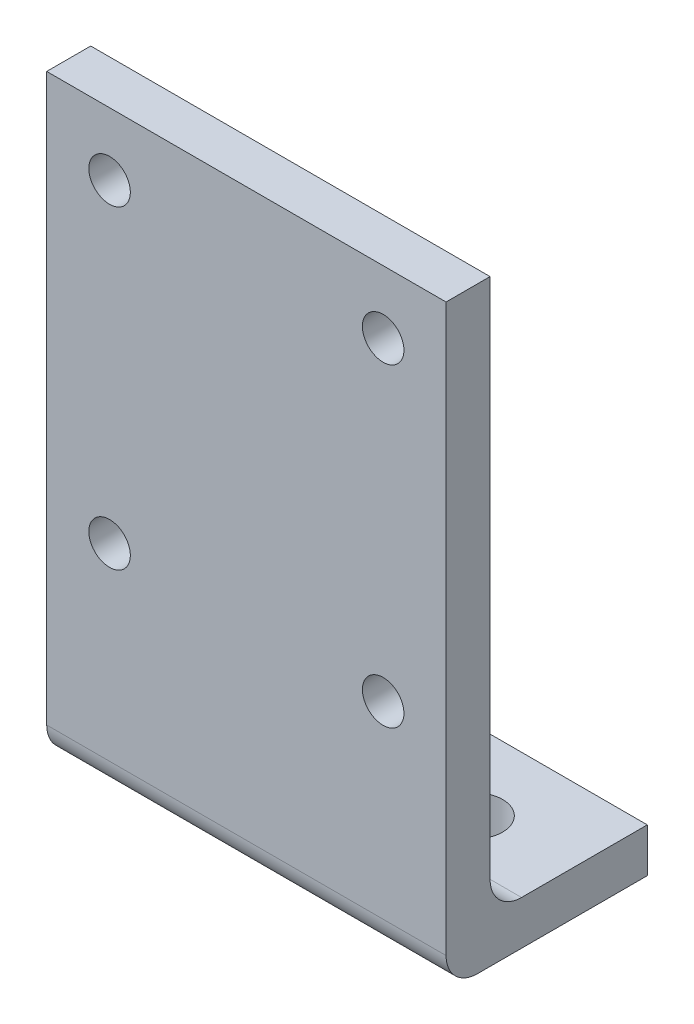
ISO-10303-21;
HEADER;
FILE_DESCRIPTION(('STEP AP214'),'2;1');
FILE_NAME('part.step','',(''),(''),'','','');
FILE_SCHEMA(('AUTOMOTIVE_DESIGN { 1 0 10303 214 1 1 1 1 }'));
ENDSEC;
DATA;
#1=APPLICATION_CONTEXT('core data for automotive mechanical design processes');
#2=APPLICATION_PROTOCOL_DEFINITION('international standard','automotive_design',2000,#1);
#3=PRODUCT_CONTEXT('',#1,'mechanical');
#4=PRODUCT('Part','Part','',(#3));
#5=PRODUCT_RELATED_PRODUCT_CATEGORY('part','',(#4));
#6=PRODUCT_DEFINITION_FORMATION('','',#4);
#7=PRODUCT_DEFINITION_CONTEXT('part definition',#1,'design');
#8=PRODUCT_DEFINITION('design','',#6,#7);
#9=PRODUCT_DEFINITION_SHAPE('','',#8);
#10=(LENGTH_UNIT() NAMED_UNIT(*) SI_UNIT(.MILLI.,.METRE.));
#11=(NAMED_UNIT(*) PLANE_ANGLE_UNIT() SI_UNIT($,.RADIAN.));
#12=(NAMED_UNIT(*) SI_UNIT($,.STERADIAN.) SOLID_ANGLE_UNIT());
#13=UNCERTAINTY_MEASURE_WITH_UNIT(LENGTH_MEASURE(1.E-05),#10,'distance_accuracy_value','');
#14=(GEOMETRIC_REPRESENTATION_CONTEXT(3) GLOBAL_UNCERTAINTY_ASSIGNED_CONTEXT((#13)) GLOBAL_UNIT_ASSIGNED_CONTEXT((#10,
#11,#12)) REPRESENTATION_CONTEXT('',''));
#15=CARTESIAN_POINT('',(0.,0.,0.));
#16=DIRECTION('',(0.,0.,1.));
#17=DIRECTION('',(1.,0.,0.));
#18=AXIS2_PLACEMENT_3D('',#15,#16,#17);
#19=CARTESIAN_POINT('',(31.75,-35.5,-5.));
#20=DIRECTION('',(1.,0.,0.));
#21=DIRECTION('',(0.,0.,-1.));
#22=AXIS2_PLACEMENT_3D('',#19,#20,#21);
#23=CYLINDRICAL_SURFACE('',#22,5.);
#24=DIRECTION('',(1.,0.,0.));
#25=VECTOR('',#24,1.);
#26=CARTESIAN_POINT('',(31.75,-40.5,-5.));
#27=LINE('',#26,#25);
#28=CARTESIAN_POINT('',(-31.75,-40.5,-5.));
#29=VERTEX_POINT('',#28);
#30=CARTESIAN_POINT('',(31.75,-40.5,-5.));
#31=VERTEX_POINT('',#30);
#32=EDGE_CURVE('E182',#29,#31,#27,.T.);
#33=ORIENTED_EDGE('',*,*,#32,.F.);
#34=CARTESIAN_POINT('',(-31.75,-35.5,-5.));
#35=DIRECTION('',(1.,0.,0.));
#36=DIRECTION('',(0.,0.,-1.));
#37=AXIS2_PLACEMENT_3D('',#34,#35,#36);
#38=CIRCLE('',#37,5.);
#39=CARTESIAN_POINT('',(-31.75,-35.5,0.));
#40=VERTEX_POINT('',#39);
#41=EDGE_CURVE('E46',#29,#40,#38,.F.);
#42=ORIENTED_EDGE('',*,*,#41,.T.);
#43=DIRECTION('',(1.,0.,0.));
#44=VECTOR('',#43,1.);
#45=CARTESIAN_POINT('',(31.75,-35.5,0.));
#46=LINE('',#45,#44);
#47=CARTESIAN_POINT('',(31.75,-35.5,0.));
#48=VERTEX_POINT('',#47);
#49=EDGE_CURVE('E185',#48,#40,#46,.F.);
#50=ORIENTED_EDGE('',*,*,#49,.F.);
#51=CARTESIAN_POINT('',(31.75,-35.5,-5.));
#52=DIRECTION('',(-1.,0.,0.));
#53=DIRECTION('',(0.,0.,1.));
#54=AXIS2_PLACEMENT_3D('',#51,#52,#53);
#55=CIRCLE('',#54,5.);
#56=EDGE_CURVE('E12',#48,#31,#55,.F.);
#57=ORIENTED_EDGE('',*,*,#56,.T.);
#58=EDGE_LOOP('',(#33,#42,#50,#57));
#59=FACE_BOUND('',#58,.T.);
#60=ADVANCED_FACE('F39',(#59),#23,.F.);
#61=CARTESIAN_POINT('',(-31.75,-42.5,2.));
#62=DIRECTION('',(-1.,0.,0.));
#63=DIRECTION('',(0.,0.,1.));
#64=AXIS2_PLACEMENT_3D('',#61,#62,#63);
#65=CYLINDRICAL_SURFACE('',#64,5.);
#66=DIRECTION('',(-1.,0.,0.));
#67=VECTOR('',#66,1.);
#68=CARTESIAN_POINT('',(-31.75,-47.5,2.));
#69=LINE('',#68,#67);
#70=CARTESIAN_POINT('',(31.75,-47.5,2.));
#71=VERTEX_POINT('',#70);
#72=CARTESIAN_POINT('',(-31.75,-47.5,2.));
#73=VERTEX_POINT('',#72);
#74=EDGE_CURVE('E202',#71,#73,#69,.T.);
#75=ORIENTED_EDGE('',*,*,#74,.F.);
#76=CARTESIAN_POINT('',(31.75,-42.5,2.));
#77=DIRECTION('',(-1.,0.,0.));
#78=DIRECTION('',(0.,0.,1.));
#79=AXIS2_PLACEMENT_3D('',#76,#77,#78);
#80=CIRCLE('',#79,5.);
#81=CARTESIAN_POINT('',(31.75,-42.5,7.));
#82=VERTEX_POINT('',#81);
#83=EDGE_CURVE('E105',#82,#71,#80,.F.);
#84=ORIENTED_EDGE('',*,*,#83,.F.);
#85=DIRECTION('',(-1.,0.,0.));
#86=VECTOR('',#85,1.);
#87=CARTESIAN_POINT('',(31.75,-42.5,7.));
#88=LINE('',#87,#86);
#89=CARTESIAN_POINT('',(-31.75,-42.5,7.));
#90=VERTEX_POINT('',#89);
#91=EDGE_CURVE('E197',#90,#82,#88,.F.);
#92=ORIENTED_EDGE('',*,*,#91,.F.);
#93=CARTESIAN_POINT('',(-31.75,-42.5,2.));
#94=DIRECTION('',(1.,0.,0.));
#95=DIRECTION('',(0.,0.,-1.));
#96=AXIS2_PLACEMENT_3D('',#93,#94,#95);
#97=CIRCLE('',#96,5.);
#98=EDGE_CURVE('E191',#73,#90,#97,.F.);
#99=ORIENTED_EDGE('',*,*,#98,.F.);
#100=EDGE_LOOP('',(#75,#84,#92,#99));
#101=FACE_BOUND('',#100,.T.);
#102=ADVANCED_FACE('F285',(#101),#65,.T.);
#103=CARTESIAN_POINT('',(31.75,-40.5,-25.));
#104=DIRECTION('',(0.,-1.,0.));
#105=DIRECTION('',(0.,0.,-1.));
#106=AXIS2_PLACEMENT_3D('',#103,#104,#105);
#107=PLANE('',#106);
#108=DIRECTION('',(0.,0.,1.));
#109=VECTOR('',#108,1.);
#110=CARTESIAN_POINT('',(-31.75,-40.5,-25.));
#111=LINE('',#110,#109);
#112=CARTESIAN_POINT('',(-31.75,-40.5,-25.));
#113=VERTEX_POINT('',#112);
#114=EDGE_CURVE('E181',#113,#29,#111,.T.);
#115=ORIENTED_EDGE('',*,*,#114,.T.);
#116=ORIENTED_EDGE('',*,*,#32,.T.);
#117=DIRECTION('',(0.,0.,1.));
#118=VECTOR('',#117,1.);
#119=CARTESIAN_POINT('',(31.75,-40.5,-25.));
#120=LINE('',#119,#118);
#121=CARTESIAN_POINT('',(31.75,-40.5,-25.));
#122=VERTEX_POINT('',#121);
#123=EDGE_CURVE('E264',#122,#31,#120,.T.);
#124=ORIENTED_EDGE('',*,*,#123,.F.);
#125=DIRECTION('',(1.,0.,0.));
#126=VECTOR('',#125,1.);
#127=CARTESIAN_POINT('',(31.75,-40.5,-25.));
#128=LINE('',#127,#126);
#129=EDGE_CURVE('E122',#113,#122,#128,.T.);
#130=ORIENTED_EDGE('',*,*,#129,.F.);
#131=EDGE_LOOP('',(#115,#116,#124,#130));
#132=FACE_BOUND('',#131,.T.);
#133=CARTESIAN_POINT('',(16.75,-40.5,-12.5));
#134=DIRECTION('',(0.,1.,0.));
#135=DIRECTION('',(0.,0.,1.));
#136=AXIS2_PLACEMENT_3D('',#133,#134,#135);
#137=CIRCLE('',#136,4.49999999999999);
#138=CARTESIAN_POINT('',(16.75,-40.5,-8.00000000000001));
#139=VERTEX_POINT('',#138);
#140=EDGE_CURVE('E147',#139,#139,#137,.T.);
#141=ORIENTED_EDGE('',*,*,#140,.F.);
#142=EDGE_LOOP('',(#141));
#143=FACE_BOUND('',#142,.T.);
#144=CARTESIAN_POINT('',(-16.75,-40.5,-12.5));
#145=DIRECTION('',(0.,1.,0.));
#146=DIRECTION('',(0.,0.,1.));
#147=AXIS2_PLACEMENT_3D('',#144,#145,#146);
#148=CIRCLE('',#147,4.49999999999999);
#149=CARTESIAN_POINT('',(-16.75,-40.5,-8.00000000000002));
#150=VERTEX_POINT('',#149);
#151=EDGE_CURVE('E322',#150,#150,#148,.T.);
#152=ORIENTED_EDGE('',*,*,#151,.F.);
#153=EDGE_LOOP('',(#152));
#154=FACE_BOUND('',#153,.T.);
#155=ADVANCED_FACE('F272',(#132,#143,#154),#107,.F.);
#156=CARTESIAN_POINT('',(31.75,-47.5,7.));
#157=DIRECTION('',(-1.,0.,0.));
#158=DIRECTION('',(0.,0.,1.));
#159=AXIS2_PLACEMENT_3D('',#156,#157,#158);
#160=PLANE('',#159);
#161=ORIENTED_EDGE('',*,*,#56,.F.);
#162=DIRECTION('',(0.,1.,0.));
#163=VECTOR('',#162,1.);
#164=CARTESIAN_POINT('',(31.75,-47.5,0.));
#165=LINE('',#164,#163);
#166=CARTESIAN_POINT('',(31.75,47.5,0.));
#167=VERTEX_POINT('',#166);
#168=EDGE_CURVE('E178',#48,#167,#165,.T.);
#169=ORIENTED_EDGE('',*,*,#168,.T.);
#170=DIRECTION('',(0.,0.,-1.));
#171=VECTOR('',#170,1.);
#172=CARTESIAN_POINT('',(31.75,47.5,7.));
#173=LINE('',#172,#171);
#174=CARTESIAN_POINT('',(31.75,47.5,7.));
#175=VERTEX_POINT('',#174);
#176=EDGE_CURVE('E203',#175,#167,#173,.T.);
#177=ORIENTED_EDGE('',*,*,#176,.F.);
#178=DIRECTION('',(0.,1.,0.));
#179=VECTOR('',#178,1.);
#180=CARTESIAN_POINT('',(31.75,-47.5,7.));
#181=LINE('',#180,#179);
#182=EDGE_CURVE('E164',#82,#175,#181,.T.);
#183=ORIENTED_EDGE('',*,*,#182,.F.);
#184=ORIENTED_EDGE('',*,*,#83,.T.);
#185=DIRECTION('',(0.,0.,-1.));
#186=VECTOR('',#185,1.);
#187=CARTESIAN_POINT('',(31.75,-47.5,7.));
#188=LINE('',#187,#186);
#189=CARTESIAN_POINT('',(31.75,-47.5,-25.));
#190=VERTEX_POINT('',#189);
#191=EDGE_CURVE('E99',#71,#190,#188,.T.);
#192=ORIENTED_EDGE('',*,*,#191,.T.);
#193=DIRECTION('',(0.,-1.,0.));
#194=VECTOR('',#193,1.);
#195=CARTESIAN_POINT('',(31.75,-47.5,-25.));
#196=LINE('',#195,#194);
#197=EDGE_CURVE('E103',#122,#190,#196,.T.);
#198=ORIENTED_EDGE('',*,*,#197,.F.);
#199=ORIENTED_EDGE('',*,*,#123,.T.);
#200=EDGE_LOOP('',(#161,#169,#177,#183,#184,#192,#198,#199));
#201=FACE_BOUND('',#200,.T.);
#202=ADVANCED_FACE('F101',(#201),#160,.F.);
#203=CARTESIAN_POINT('',(-31.75,47.5,7.));
#204=DIRECTION('',(0.,-1.,0.));
#205=DIRECTION('',(0.,0.,-1.));
#206=AXIS2_PLACEMENT_3D('',#203,#204,#205);
#207=PLANE('',#206);
#208=DIRECTION('',(-1.,0.,0.));
#209=VECTOR('',#208,1.);
#210=CARTESIAN_POINT('',(-31.75,47.5,0.));
#211=LINE('',#210,#209);
#212=CARTESIAN_POINT('',(-31.75,47.5,0.));
#213=VERTEX_POINT('',#212);
#214=EDGE_CURVE('E175',#167,#213,#211,.T.);
#215=ORIENTED_EDGE('',*,*,#214,.T.);
#216=DIRECTION('',(0.,0.,-1.));
#217=VECTOR('',#216,1.);
#218=CARTESIAN_POINT('',(-31.75,47.5,7.));
#219=LINE('',#218,#217);
#220=CARTESIAN_POINT('',(-31.75,47.5,7.));
#221=VERTEX_POINT('',#220);
#222=EDGE_CURVE('E256',#221,#213,#219,.T.);
#223=ORIENTED_EDGE('',*,*,#222,.F.);
#224=DIRECTION('',(-1.,0.,0.));
#225=VECTOR('',#224,1.);
#226=CARTESIAN_POINT('',(-31.75,47.5,7.));
#227=LINE('',#226,#225);
#228=EDGE_CURVE('E167',#175,#221,#227,.T.);
#229=ORIENTED_EDGE('',*,*,#228,.F.);
#230=ORIENTED_EDGE('',*,*,#176,.T.);
#231=EDGE_LOOP('',(#215,#223,#229,#230));
#232=FACE_BOUND('',#231,.T.);
#233=ADVANCED_FACE('F275',(#232),#207,.F.);
#234=CARTESIAN_POINT('',(-31.75,-47.5,7.));
#235=DIRECTION('',(1.,0.,0.));
#236=DIRECTION('',(0.,0.,-1.));
#237=AXIS2_PLACEMENT_3D('',#234,#235,#236);
#238=PLANE('',#237);
#239=DIRECTION('',(0.,0.,-1.));
#240=VECTOR('',#239,1.);
#241=CARTESIAN_POINT('',(-31.75,-47.5,7.));
#242=LINE('',#241,#240);
#243=CARTESIAN_POINT('',(-31.75,-47.5,-25.));
#244=VERTEX_POINT('',#243);
#245=EDGE_CURVE('E109',#73,#244,#242,.T.);
#246=ORIENTED_EDGE('',*,*,#245,.F.);
#247=ORIENTED_EDGE('',*,*,#98,.T.);
#248=DIRECTION('',(0.,-1.,0.));
#249=VECTOR('',#248,1.);
#250=CARTESIAN_POINT('',(-31.75,-47.5,7.));
#251=LINE('',#250,#249);
#252=EDGE_CURVE('E110',#221,#90,#251,.T.);
#253=ORIENTED_EDGE('',*,*,#252,.F.);
#254=ORIENTED_EDGE('',*,*,#222,.T.);
#255=DIRECTION('',(0.,-1.,0.));
#256=VECTOR('',#255,1.);
#257=CARTESIAN_POINT('',(-31.75,-47.5,0.));
#258=LINE('',#257,#256);
#259=EDGE_CURVE('E168',#213,#40,#258,.T.);
#260=ORIENTED_EDGE('',*,*,#259,.T.);
#261=ORIENTED_EDGE('',*,*,#41,.F.);
#262=ORIENTED_EDGE('',*,*,#114,.F.);
#263=DIRECTION('',(0.,1.,0.));
#264=VECTOR('',#263,1.);
#265=CARTESIAN_POINT('',(-31.75,-47.5,-25.));
#266=LINE('',#265,#264);
#267=EDGE_CURVE('E118',#244,#113,#266,.T.);
#268=ORIENTED_EDGE('',*,*,#267,.F.);
#269=EDGE_LOOP('',(#246,#247,#253,#254,#260,#261,#262,#268));
#270=FACE_BOUND('',#269,.T.);
#271=ADVANCED_FACE('F255',(#270),#238,.F.);
#272=CARTESIAN_POINT('',(-31.75,-47.5,7.));
#273=DIRECTION('',(0.,1.,0.));
#274=DIRECTION('',(0.,0.,1.));
#275=AXIS2_PLACEMENT_3D('',#272,#273,#274);
#276=PLANE('',#275);
#277=CARTESIAN_POINT('',(-16.75,-47.5,-12.5));
#278=DIRECTION('',(0.,1.,0.));
#279=DIRECTION('',(0.,0.,1.));
#280=AXIS2_PLACEMENT_3D('',#277,#278,#279);
#281=CIRCLE('',#280,4.49999999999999);
#282=CARTESIAN_POINT('',(-16.75,-47.5,-8.00000000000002));
#283=VERTEX_POINT('',#282);
#284=EDGE_CURVE('E153',#283,#283,#281,.T.);
#285=ORIENTED_EDGE('',*,*,#284,.T.);
#286=EDGE_LOOP('',(#285));
#287=FACE_BOUND('',#286,.T.);
#288=CARTESIAN_POINT('',(16.75,-47.5,-12.5));
#289=DIRECTION('',(0.,1.,0.));
#290=DIRECTION('',(0.,0.,1.));
#291=AXIS2_PLACEMENT_3D('',#288,#289,#290);
#292=CIRCLE('',#291,4.49999999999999);
#293=CARTESIAN_POINT('',(16.75,-47.5,-8.00000000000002));
#294=VERTEX_POINT('',#293);
#295=EDGE_CURVE('E152',#294,#294,#292,.T.);
#296=ORIENTED_EDGE('',*,*,#295,.T.);
#297=EDGE_LOOP('',(#296));
#298=FACE_BOUND('',#297,.T.);
#299=ORIENTED_EDGE('',*,*,#191,.F.);
#300=ORIENTED_EDGE('',*,*,#74,.T.);
#301=ORIENTED_EDGE('',*,*,#245,.T.);
#302=DIRECTION('',(-1.,0.,0.));
#303=VECTOR('',#302,1.);
#304=CARTESIAN_POINT('',(31.75,-47.5,-25.));
#305=LINE('',#304,#303);
#306=EDGE_CURVE('E113',#190,#244,#305,.T.);
#307=ORIENTED_EDGE('',*,*,#306,.F.);
#308=EDGE_LOOP('',(#299,#300,#301,#307));
#309=FACE_BOUND('',#308,.T.);
#310=ADVANCED_FACE('F114',(#287,#298,#309),#276,.F.);
#311=CARTESIAN_POINT('',(31.75,47.5,7.));
#312=DIRECTION('',(0.,0.,-1.));
#313=DIRECTION('',(-1.,0.,0.));
#314=AXIS2_PLACEMENT_3D('',#311,#312,#313);
#315=PLANE('',#314);
#316=CARTESIAN_POINT('',(-21.75,37.5,7.));
#317=DIRECTION('',(0.,0.,1.));
#318=DIRECTION('',(1.,0.,0.));
#319=AXIS2_PLACEMENT_3D('',#316,#317,#318);
#320=CIRCLE('',#319,3.29999999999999);
#321=CARTESIAN_POINT('',(-18.45,37.5,7.));
#322=VERTEX_POINT('',#321);
#323=EDGE_CURVE('E208',#322,#322,#320,.T.);
#324=ORIENTED_EDGE('',*,*,#323,.F.);
#325=EDGE_LOOP('',(#324));
#326=FACE_BOUND('',#325,.T.);
#327=CARTESIAN_POINT('',(21.75,37.5,7.));
#328=DIRECTION('',(0.,0.,1.));
#329=DIRECTION('',(1.,0.,0.));
#330=AXIS2_PLACEMENT_3D('',#327,#328,#329);
#331=CIRCLE('',#330,3.29999999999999);
#332=CARTESIAN_POINT('',(25.05,37.5,7.));
#333=VERTEX_POINT('',#332);
#334=EDGE_CURVE('E207',#333,#333,#331,.T.);
#335=ORIENTED_EDGE('',*,*,#334,.F.);
#336=EDGE_LOOP('',(#335));
#337=FACE_BOUND('',#336,.T.);
#338=CARTESIAN_POINT('',(21.75,-12.5,7.));
#339=DIRECTION('',(0.,0.,1.));
#340=DIRECTION('',(1.,0.,0.));
#341=AXIS2_PLACEMENT_3D('',#338,#339,#340);
#342=CIRCLE('',#341,3.29999999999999);
#343=CARTESIAN_POINT('',(25.05,-12.5,7.));
#344=VERTEX_POINT('',#343);
#345=EDGE_CURVE('E222',#344,#344,#342,.T.);
#346=ORIENTED_EDGE('',*,*,#345,.F.);
#347=EDGE_LOOP('',(#346));
#348=FACE_BOUND('',#347,.T.);
#349=CARTESIAN_POINT('',(-21.75,-12.5,7.));
#350=DIRECTION('',(0.,0.,1.));
#351=DIRECTION('',(1.,0.,0.));
#352=AXIS2_PLACEMENT_3D('',#349,#350,#351);
#353=CIRCLE('',#352,3.29999999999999);
#354=CARTESIAN_POINT('',(-18.45,-12.5,7.));
#355=VERTEX_POINT('',#354);
#356=EDGE_CURVE('E127',#355,#355,#353,.T.);
#357=ORIENTED_EDGE('',*,*,#356,.F.);
#358=EDGE_LOOP('',(#357));
#359=FACE_BOUND('',#358,.T.);
#360=ORIENTED_EDGE('',*,*,#252,.T.);
#361=ORIENTED_EDGE('',*,*,#91,.T.);
#362=ORIENTED_EDGE('',*,*,#182,.T.);
#363=ORIENTED_EDGE('',*,*,#228,.T.);
#364=EDGE_LOOP('',(#360,#361,#362,#363));
#365=FACE_BOUND('',#364,.T.);
#366=ADVANCED_FACE('F244',(#326,#337,#348,#359,#365),#315,.F.);
#367=CARTESIAN_POINT('',(31.75,47.5,0.));
#368=DIRECTION('',(0.,0.,-1.));
#369=DIRECTION('',(-1.,0.,0.));
#370=AXIS2_PLACEMENT_3D('',#367,#368,#369);
#371=PLANE('',#370);
#372=CARTESIAN_POINT('',(-21.75,37.5,0.));
#373=DIRECTION('',(0.,0.,-1.));
#374=DIRECTION('',(-1.,0.,0.));
#375=AXIS2_PLACEMENT_3D('',#372,#373,#374);
#376=CIRCLE('',#375,3.29999999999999);
#377=CARTESIAN_POINT('',(-25.05,37.5,0.));
#378=VERTEX_POINT('',#377);
#379=EDGE_CURVE('E204',#378,#378,#376,.T.);
#380=ORIENTED_EDGE('',*,*,#379,.F.);
#381=EDGE_LOOP('',(#380));
#382=FACE_BOUND('',#381,.T.);
#383=CARTESIAN_POINT('',(21.75,37.5,0.));
#384=DIRECTION('',(0.,0.,-1.));
#385=DIRECTION('',(-1.,0.,0.));
#386=AXIS2_PLACEMENT_3D('',#383,#384,#385);
#387=CIRCLE('',#386,3.29999999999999);
#388=CARTESIAN_POINT('',(18.45,37.5,0.));
#389=VERTEX_POINT('',#388);
#390=EDGE_CURVE('E209',#389,#389,#387,.T.);
#391=ORIENTED_EDGE('',*,*,#390,.F.);
#392=EDGE_LOOP('',(#391));
#393=FACE_BOUND('',#392,.T.);
#394=CARTESIAN_POINT('',(21.75,-12.5,0.));
#395=DIRECTION('',(0.,0.,-1.));
#396=DIRECTION('',(-1.,0.,0.));
#397=AXIS2_PLACEMENT_3D('',#394,#395,#396);
#398=CIRCLE('',#397,3.29999999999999);
#399=CARTESIAN_POINT('',(18.45,-12.5,0.));
#400=VERTEX_POINT('',#399);
#401=EDGE_CURVE('E218',#400,#400,#398,.T.);
#402=ORIENTED_EDGE('',*,*,#401,.F.);
#403=EDGE_LOOP('',(#402));
#404=FACE_BOUND('',#403,.T.);
#405=CARTESIAN_POINT('',(-21.75,-12.5,0.));
#406=DIRECTION('',(0.,0.,-1.));
#407=DIRECTION('',(-1.,0.,0.));
#408=AXIS2_PLACEMENT_3D('',#405,#406,#407);
#409=CIRCLE('',#408,3.29999999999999);
#410=CARTESIAN_POINT('',(-25.05,-12.5,0.));
#411=VERTEX_POINT('',#410);
#412=EDGE_CURVE('E124',#411,#411,#409,.T.);
#413=ORIENTED_EDGE('',*,*,#412,.F.);
#414=EDGE_LOOP('',(#413));
#415=FACE_BOUND('',#414,.T.);
#416=ORIENTED_EDGE('',*,*,#168,.F.);
#417=ORIENTED_EDGE('',*,*,#49,.T.);
#418=ORIENTED_EDGE('',*,*,#259,.F.);
#419=ORIENTED_EDGE('',*,*,#214,.F.);
#420=EDGE_LOOP('',(#416,#417,#418,#419));
#421=FACE_BOUND('',#420,.T.);
#422=ADVANCED_FACE('F247',(#382,#393,#404,#415,#421),#371,.T.);
#423=CARTESIAN_POINT('',(31.75,-40.5,-25.));
#424=DIRECTION('',(0.,0.,1.));
#425=DIRECTION('',(1.,0.,0.));
#426=AXIS2_PLACEMENT_3D('',#423,#424,#425);
#427=PLANE('',#426);
#428=ORIENTED_EDGE('',*,*,#197,.T.);
#429=ORIENTED_EDGE('',*,*,#306,.T.);
#430=ORIENTED_EDGE('',*,*,#267,.T.);
#431=ORIENTED_EDGE('',*,*,#129,.T.);
#432=EDGE_LOOP('',(#428,#429,#430,#431));
#433=FACE_BOUND('',#432,.T.);
#434=ADVANCED_FACE('F120',(#433),#427,.F.);
#435=CARTESIAN_POINT('',(-21.75,-12.5,7.));
#436=DIRECTION('',(0.,0.,1.));
#437=DIRECTION('',(1.,0.,0.));
#438=AXIS2_PLACEMENT_3D('',#435,#436,#437);
#439=CYLINDRICAL_SURFACE('',#438,3.29999999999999);
#440=ORIENTED_EDGE('',*,*,#412,.T.);
#441=EDGE_LOOP('',(#440));
#442=FACE_BOUND('',#441,.T.);
#443=ORIENTED_EDGE('',*,*,#356,.T.);
#444=EDGE_LOOP('',(#443));
#445=FACE_BOUND('',#444,.T.);
#446=ADVANCED_FACE('F342',(#442,#445),#439,.F.);
#447=CARTESIAN_POINT('',(21.75,-12.5,7.));
#448=DIRECTION('',(0.,0.,1.));
#449=DIRECTION('',(1.,0.,0.));
#450=AXIS2_PLACEMENT_3D('',#447,#448,#449);
#451=CYLINDRICAL_SURFACE('',#450,3.29999999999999);
#452=ORIENTED_EDGE('',*,*,#401,.T.);
#453=EDGE_LOOP('',(#452));
#454=FACE_BOUND('',#453,.T.);
#455=ORIENTED_EDGE('',*,*,#345,.T.);
#456=EDGE_LOOP('',(#455));
#457=FACE_BOUND('',#456,.T.);
#458=ADVANCED_FACE('F242',(#454,#457),#451,.F.);
#459=CARTESIAN_POINT('',(21.75,37.5,7.));
#460=DIRECTION('',(0.,0.,1.));
#461=DIRECTION('',(1.,0.,0.));
#462=AXIS2_PLACEMENT_3D('',#459,#460,#461);
#463=CYLINDRICAL_SURFACE('',#462,3.29999999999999);
#464=ORIENTED_EDGE('',*,*,#390,.T.);
#465=EDGE_LOOP('',(#464));
#466=FACE_BOUND('',#465,.T.);
#467=ORIENTED_EDGE('',*,*,#334,.T.);
#468=EDGE_LOOP('',(#467));
#469=FACE_BOUND('',#468,.T.);
#470=ADVANCED_FACE('F337',(#466,#469),#463,.F.);
#471=CARTESIAN_POINT('',(-21.75,37.5,7.));
#472=DIRECTION('',(0.,0.,1.));
#473=DIRECTION('',(1.,0.,0.));
#474=AXIS2_PLACEMENT_3D('',#471,#472,#473);
#475=CYLINDRICAL_SURFACE('',#474,3.29999999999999);
#476=ORIENTED_EDGE('',*,*,#379,.T.);
#477=EDGE_LOOP('',(#476));
#478=FACE_BOUND('',#477,.T.);
#479=ORIENTED_EDGE('',*,*,#323,.T.);
#480=EDGE_LOOP('',(#479));
#481=FACE_BOUND('',#480,.T.);
#482=ADVANCED_FACE('F316',(#478,#481),#475,.F.);
#483=CARTESIAN_POINT('',(16.75,-40.5,-12.5));
#484=DIRECTION('',(0.,1.,0.));
#485=DIRECTION('',(0.,0.,1.));
#486=AXIS2_PLACEMENT_3D('',#483,#484,#485);
#487=CYLINDRICAL_SURFACE('',#486,4.49999999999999);
#488=ORIENTED_EDGE('',*,*,#295,.F.);
#489=EDGE_LOOP('',(#488));
#490=FACE_BOUND('',#489,.T.);
#491=ORIENTED_EDGE('',*,*,#140,.T.);
#492=EDGE_LOOP('',(#491));
#493=FACE_BOUND('',#492,.T.);
#494=ADVANCED_FACE('F312',(#490,#493),#487,.F.);
#495=CARTESIAN_POINT('',(-16.75,-40.5,-12.5));
#496=DIRECTION('',(0.,1.,0.));
#497=DIRECTION('',(0.,0.,1.));
#498=AXIS2_PLACEMENT_3D('',#495,#496,#497);
#499=CYLINDRICAL_SURFACE('',#498,4.49999999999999);
#500=ORIENTED_EDGE('',*,*,#284,.F.);
#501=EDGE_LOOP('',(#500));
#502=FACE_BOUND('',#501,.T.);
#503=ORIENTED_EDGE('',*,*,#151,.T.);
#504=EDGE_LOOP('',(#503));
#505=FACE_BOUND('',#504,.T.);
#506=ADVANCED_FACE('F315',(#502,#505),#499,.F.);
#507=CLOSED_SHELL('',(#60,#102,#155,#202,#233,#271,#310,#366,#422,#434,#446,#458,#470,#482,#494,#506));
#508=MANIFOLD_SOLID_BREP('B2',#507);
#509=ADVANCED_BREP_SHAPE_REPRESENTATION('',(#18,#508),#14);
#510=SHAPE_DEFINITION_REPRESENTATION(#9,#509);
ENDSEC;
END-ISO-10303-21;
